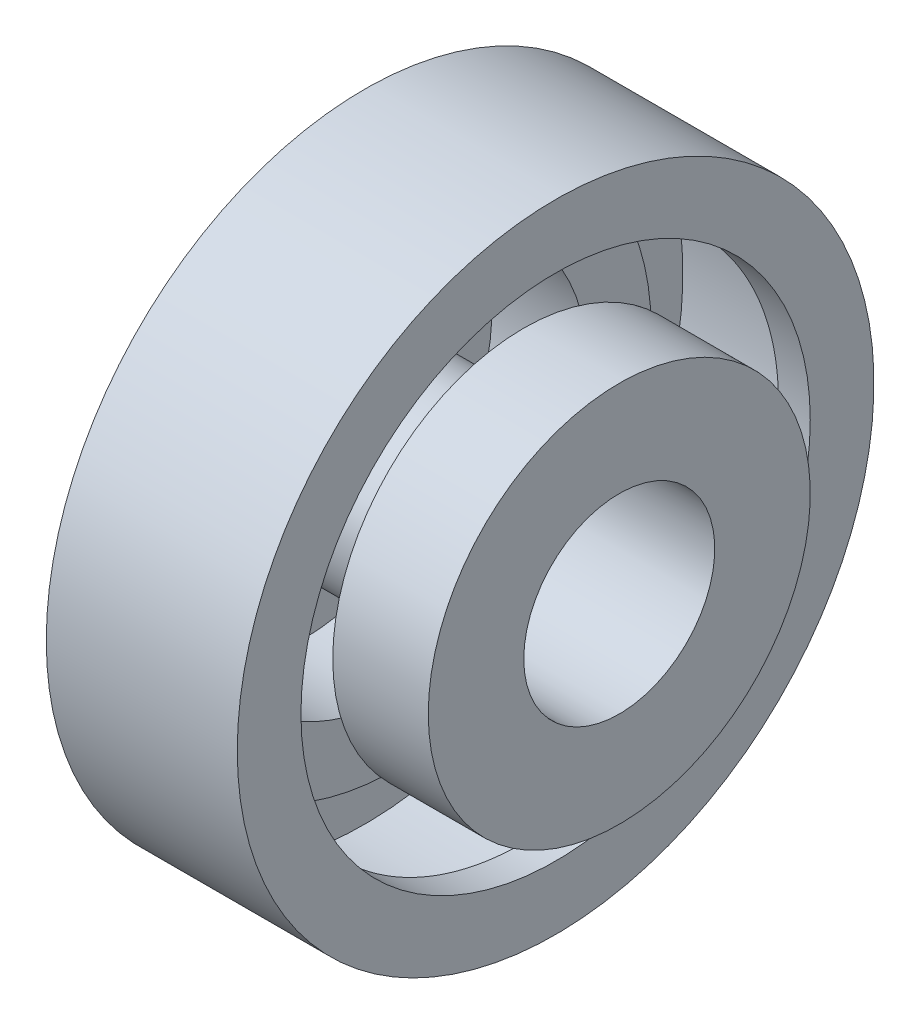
ISO-10303-21;
HEADER;
FILE_DESCRIPTION(('STEP AP214'),'2;1');
FILE_NAME('part.step','',(''),(''),'','','');
FILE_SCHEMA(('AUTOMOTIVE_DESIGN { 1 0 10303 214 1 1 1 1 }'));
ENDSEC;
DATA;
#1=APPLICATION_CONTEXT('core data for automotive mechanical design processes');
#2=APPLICATION_PROTOCOL_DEFINITION('international standard','automotive_design',2000,#1);
#3=PRODUCT_CONTEXT('',#1,'mechanical');
#4=PRODUCT('Part','Part','',(#3));
#5=PRODUCT_RELATED_PRODUCT_CATEGORY('part','',(#4));
#6=PRODUCT_DEFINITION_FORMATION('','',#4);
#7=PRODUCT_DEFINITION_CONTEXT('part definition',#1,'design');
#8=PRODUCT_DEFINITION('design','',#6,#7);
#9=PRODUCT_DEFINITION_SHAPE('','',#8);
#10=(LENGTH_UNIT() NAMED_UNIT(*) SI_UNIT(.MILLI.,.METRE.));
#11=(NAMED_UNIT(*) PLANE_ANGLE_UNIT() SI_UNIT($,.RADIAN.));
#12=(NAMED_UNIT(*) SI_UNIT($,.STERADIAN.) SOLID_ANGLE_UNIT());
#13=UNCERTAINTY_MEASURE_WITH_UNIT(LENGTH_MEASURE(1.E-05),#10,'distance_accuracy_value','');
#14=(GEOMETRIC_REPRESENTATION_CONTEXT(3) GLOBAL_UNCERTAINTY_ASSIGNED_CONTEXT((#13)) GLOBAL_UNIT_ASSIGNED_CONTEXT((#10,
#11,#12)) REPRESENTATION_CONTEXT('',''));
#15=CARTESIAN_POINT('',(0.,0.,0.));
#16=DIRECTION('',(0.,0.,1.));
#17=DIRECTION('',(1.,0.,0.));
#18=AXIS2_PLACEMENT_3D('',#15,#16,#17);
#19=CARTESIAN_POINT('',(2.,6.,0.));
#20=DIRECTION('',(-1.,0.,0.));
#21=DIRECTION('',(0.,0.,1.));
#22=AXIS2_PLACEMENT_3D('',#19,#20,#21);
#23=PLANE('',#22);
#24=CARTESIAN_POINT('',(2.,0.,-7.));
#25=DIRECTION('',(1.,0.,0.));
#26=DIRECTION('',(0.,0.,-1.));
#27=AXIS2_PLACEMENT_3D('',#24,#25,#26);
#28=CIRCLE('',#27,1.);
#29=CARTESIAN_POINT('',(2.,0.,-8.));
#30=VERTEX_POINT('',#29);
#31=CARTESIAN_POINT('',(2.,0.,-6.));
#32=VERTEX_POINT('',#31);
#33=EDGE_CURVE('E45',#30,#32,#28,.T.);
#34=ORIENTED_EDGE('',*,*,#33,.F.);
#35=CARTESIAN_POINT('',(2.,0.,0.));
#36=DIRECTION('',(-1.,0.,0.));
#37=DIRECTION('',(0.,0.,1.));
#38=AXIS2_PLACEMENT_3D('',#35,#36,#37);
#39=CIRCLE('',#38,8.);
#40=EDGE_CURVE('E64',#30,#30,#39,.T.);
#41=ORIENTED_EDGE('',*,*,#40,.F.);
#42=EDGE_CURVE('E57',#32,#30,#28,.T.);
#43=ORIENTED_EDGE('',*,*,#42,.F.);
#44=CARTESIAN_POINT('',(2.,0.,0.));
#45=DIRECTION('',(-1.,0.,0.));
#46=DIRECTION('',(0.,0.,1.));
#47=AXIS2_PLACEMENT_3D('',#44,#45,#46);
#48=CIRCLE('',#47,6.);
#49=EDGE_CURVE('E39',#32,#32,#48,.T.);
#50=ORIENTED_EDGE('',*,*,#49,.T.);
#51=EDGE_LOOP('',(#34,#41,#43,#50));
#52=FACE_BOUND('',#51,.T.);
#53=ADVANCED_FACE('F31',(#52),#23,.F.);
#54=CARTESIAN_POINT('',(5.,3.,0.));
#55=DIRECTION('',(-1.,0.,0.));
#56=DIRECTION('',(0.,0.,1.));
#57=AXIS2_PLACEMENT_3D('',#54,#55,#56);
#58=PLANE('',#57);
#59=CARTESIAN_POINT('',(5.,0.,0.));
#60=DIRECTION('',(-1.,0.,0.));
#61=DIRECTION('',(0.,0.,1.));
#62=AXIS2_PLACEMENT_3D('',#59,#60,#61);
#63=CIRCLE('',#62,6.00000000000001);
#64=CARTESIAN_POINT('',(5.,0.,6.00000000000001));
#65=VERTEX_POINT('',#64);
#66=EDGE_CURVE('E11',#65,#65,#63,.T.);
#67=ORIENTED_EDGE('',*,*,#66,.F.);
#68=EDGE_LOOP('',(#67));
#69=FACE_BOUND('',#68,.T.);
#70=CARTESIAN_POINT('',(5.,0.,0.));
#71=DIRECTION('',(-1.,0.,0.));
#72=DIRECTION('',(0.,0.,1.));
#73=AXIS2_PLACEMENT_3D('',#70,#71,#72);
#74=CIRCLE('',#73,3.);
#75=CARTESIAN_POINT('',(5.,0.,3.));
#76=VERTEX_POINT('',#75);
#77=EDGE_CURVE('E95',#76,#76,#74,.T.);
#78=ORIENTED_EDGE('',*,*,#77,.T.);
#79=EDGE_LOOP('',(#78));
#80=FACE_BOUND('',#79,.T.);
#81=ADVANCED_FACE('F33',(#69,#80),#58,.F.);
#82=CARTESIAN_POINT('',(-5.7575463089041,0.,0.));
#83=DIRECTION('',(-1.,0.,0.));
#84=DIRECTION('',(0.,0.,1.));
#85=AXIS2_PLACEMENT_3D('',#82,#83,#84);
#86=CYLINDRICAL_SURFACE('',#85,6.);
#87=ORIENTED_EDGE('',*,*,#49,.F.);
#88=EDGE_LOOP('',(#87));
#89=FACE_BOUND('',#88,.T.);
#90=ORIENTED_EDGE('',*,*,#66,.T.);
#91=EDGE_LOOP('',(#90));
#92=FACE_BOUND('',#91,.T.);
#93=ADVANCED_FACE('F125',(#89,#92),#86,.T.);
#94=CARTESIAN_POINT('',(-5.7575463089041,0.,0.));
#95=DIRECTION('',(-1.,0.,0.));
#96=DIRECTION('',(0.,0.,1.));
#97=AXIS2_PLACEMENT_3D('',#94,#95,#96);
#98=CYLINDRICAL_SURFACE('',#97,8.);
#99=CARTESIAN_POINT('',(3.,0.,0.));
#100=DIRECTION('',(-1.,0.,0.));
#101=DIRECTION('',(0.,0.,1.));
#102=AXIS2_PLACEMENT_3D('',#99,#100,#101);
#103=CIRCLE('',#102,8.);
#104=CARTESIAN_POINT('',(3.,0.,8.));
#105=VERTEX_POINT('',#104);
#106=EDGE_CURVE('E69',#105,#105,#103,.T.);
#107=ORIENTED_EDGE('',*,*,#106,.F.);
#108=EDGE_LOOP('',(#107));
#109=FACE_BOUND('',#108,.T.);
#110=ORIENTED_EDGE('',*,*,#40,.T.);
#111=EDGE_LOOP('',(#110));
#112=FACE_BOUND('',#111,.T.);
#113=ADVANCED_FACE('F68',(#109,#112),#98,.F.);
#114=CARTESIAN_POINT('',(3.,8.,0.));
#115=DIRECTION('',(-1.,0.,0.));
#116=DIRECTION('',(0.,0.,1.));
#117=AXIS2_PLACEMENT_3D('',#114,#115,#116);
#118=PLANE('',#117);
#119=CARTESIAN_POINT('',(3.,0.,0.));
#120=DIRECTION('',(-1.,0.,0.));
#121=DIRECTION('',(0.,0.,1.));
#122=AXIS2_PLACEMENT_3D('',#119,#120,#121);
#123=CIRCLE('',#122,10.);
#124=CARTESIAN_POINT('',(3.,0.,10.));
#125=VERTEX_POINT('',#124);
#126=EDGE_CURVE('E72',#125,#125,#123,.T.);
#127=ORIENTED_EDGE('',*,*,#126,.F.);
#128=EDGE_LOOP('',(#127));
#129=FACE_BOUND('',#128,.T.);
#130=ORIENTED_EDGE('',*,*,#106,.T.);
#131=EDGE_LOOP('',(#130));
#132=FACE_BOUND('',#131,.T.);
#133=ADVANCED_FACE('F134',(#129,#132),#118,.F.);
#134=CARTESIAN_POINT('',(-5.7575463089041,0.,0.));
#135=DIRECTION('',(-1.,0.,0.));
#136=DIRECTION('',(0.,0.,1.));
#137=AXIS2_PLACEMENT_3D('',#134,#135,#136);
#138=CYLINDRICAL_SURFACE('',#137,10.);
#139=CARTESIAN_POINT('',(-3.,0.,0.));
#140=DIRECTION('',(-1.,0.,0.));
#141=DIRECTION('',(0.,0.,1.));
#142=AXIS2_PLACEMENT_3D('',#139,#140,#141);
#143=CIRCLE('',#142,10.);
#144=CARTESIAN_POINT('',(-3.,0.,10.));
#145=VERTEX_POINT('',#144);
#146=EDGE_CURVE('E77',#145,#145,#143,.T.);
#147=ORIENTED_EDGE('',*,*,#146,.F.);
#148=EDGE_LOOP('',(#147));
#149=FACE_BOUND('',#148,.T.);
#150=ORIENTED_EDGE('',*,*,#126,.T.);
#151=EDGE_LOOP('',(#150));
#152=FACE_BOUND('',#151,.T.);
#153=ADVANCED_FACE('F144',(#149,#152),#138,.T.);
#154=CARTESIAN_POINT('',(-3.,8.,0.));
#155=DIRECTION('',(1.,0.,0.));
#156=DIRECTION('',(0.,0.,-1.));
#157=AXIS2_PLACEMENT_3D('',#154,#155,#156);
#158=PLANE('',#157);
#159=CARTESIAN_POINT('',(-3.,0.,0.));
#160=DIRECTION('',(-1.,0.,0.));
#161=DIRECTION('',(0.,0.,1.));
#162=AXIS2_PLACEMENT_3D('',#159,#160,#161);
#163=CIRCLE('',#162,8.);
#164=CARTESIAN_POINT('',(-3.,0.,8.));
#165=VERTEX_POINT('',#164);
#166=EDGE_CURVE('E80',#165,#165,#163,.T.);
#167=ORIENTED_EDGE('',*,*,#166,.F.);
#168=EDGE_LOOP('',(#167));
#169=FACE_BOUND('',#168,.T.);
#170=ORIENTED_EDGE('',*,*,#146,.T.);
#171=EDGE_LOOP('',(#170));
#172=FACE_BOUND('',#171,.T.);
#173=ADVANCED_FACE('F151',(#169,#172),#158,.F.);
#174=CARTESIAN_POINT('',(-5.7575463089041,0.,0.));
#175=DIRECTION('',(-1.,0.,0.));
#176=DIRECTION('',(0.,0.,1.));
#177=AXIS2_PLACEMENT_3D('',#174,#175,#176);
#178=CYLINDRICAL_SURFACE('',#177,8.);
#179=CARTESIAN_POINT('',(-2.,0.,0.));
#180=DIRECTION('',(-1.,0.,0.));
#181=DIRECTION('',(0.,0.,1.));
#182=AXIS2_PLACEMENT_3D('',#179,#180,#181);
#183=CIRCLE('',#182,8.);
#184=CARTESIAN_POINT('',(-2.,0.,-8.));
#185=VERTEX_POINT('',#184);
#186=EDGE_CURVE('E83',#185,#185,#183,.T.);
#187=ORIENTED_EDGE('',*,*,#186,.F.);
#188=EDGE_LOOP('',(#187));
#189=FACE_BOUND('',#188,.T.);
#190=ORIENTED_EDGE('',*,*,#166,.T.);
#191=EDGE_LOOP('',(#190));
#192=FACE_BOUND('',#191,.T.);
#193=ADVANCED_FACE('F158',(#189,#192),#178,.F.);
#194=CARTESIAN_POINT('',(-2.,6.,0.));
#195=DIRECTION('',(1.,0.,0.));
#196=DIRECTION('',(0.,0.,-1.));
#197=AXIS2_PLACEMENT_3D('',#194,#195,#196);
#198=PLANE('',#197);
#199=ORIENTED_EDGE('',*,*,#186,.T.);
#200=CARTESIAN_POINT('',(-2.,0.,-7.));
#201=DIRECTION('',(1.,0.,0.));
#202=DIRECTION('',(0.,0.,-1.));
#203=AXIS2_PLACEMENT_3D('',#200,#201,#202);
#204=CIRCLE('',#203,1.);
#205=CARTESIAN_POINT('',(-2.,0.,-6.));
#206=VERTEX_POINT('',#205);
#207=EDGE_CURVE('E52',#185,#206,#204,.T.);
#208=ORIENTED_EDGE('',*,*,#207,.T.);
#209=CARTESIAN_POINT('',(-2.,0.,0.));
#210=DIRECTION('',(-1.,0.,0.));
#211=DIRECTION('',(0.,0.,1.));
#212=AXIS2_PLACEMENT_3D('',#209,#210,#211);
#213=CIRCLE('',#212,6.);
#214=EDGE_CURVE('E86',#206,#206,#213,.T.);
#215=ORIENTED_EDGE('',*,*,#214,.F.);
#216=EDGE_CURVE('E66',#206,#185,#204,.T.);
#217=ORIENTED_EDGE('',*,*,#216,.T.);
#218=EDGE_LOOP('',(#199,#208,#215,#217));
#219=FACE_BOUND('',#218,.T.);
#220=ADVANCED_FACE('F100',(#219),#198,.F.);
#221=CARTESIAN_POINT('',(-5.7575463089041,0.,0.));
#222=DIRECTION('',(-1.,0.,0.));
#223=DIRECTION('',(0.,0.,1.));
#224=AXIS2_PLACEMENT_3D('',#221,#222,#223);
#225=CYLINDRICAL_SURFACE('',#224,6.);
#226=ORIENTED_EDGE('',*,*,#214,.T.);
#227=EDGE_LOOP('',(#226));
#228=FACE_BOUND('',#227,.T.);
#229=CARTESIAN_POINT('',(-5.,0.,0.));
#230=DIRECTION('',(-1.,0.,0.));
#231=DIRECTION('',(0.,0.,1.));
#232=AXIS2_PLACEMENT_3D('',#229,#230,#231);
#233=CIRCLE('',#232,6.00000000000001);
#234=CARTESIAN_POINT('',(-5.,0.,6.00000000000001));
#235=VERTEX_POINT('',#234);
#236=EDGE_CURVE('E89',#235,#235,#233,.T.);
#237=ORIENTED_EDGE('',*,*,#236,.F.);
#238=EDGE_LOOP('',(#237));
#239=FACE_BOUND('',#238,.T.);
#240=ADVANCED_FACE('F103',(#228,#239),#225,.T.);
#241=CARTESIAN_POINT('',(-5.,3.,0.));
#242=DIRECTION('',(1.,0.,0.));
#243=DIRECTION('',(0.,0.,-1.));
#244=AXIS2_PLACEMENT_3D('',#241,#242,#243);
#245=PLANE('',#244);
#246=CARTESIAN_POINT('',(-5.,0.,0.));
#247=DIRECTION('',(-1.,0.,0.));
#248=DIRECTION('',(0.,0.,1.));
#249=AXIS2_PLACEMENT_3D('',#246,#247,#248);
#250=CIRCLE('',#249,3.);
#251=CARTESIAN_POINT('',(-5.,0.,3.));
#252=VERTEX_POINT('',#251);
#253=EDGE_CURVE('E92',#252,#252,#250,.T.);
#254=ORIENTED_EDGE('',*,*,#253,.F.);
#255=EDGE_LOOP('',(#254));
#256=FACE_BOUND('',#255,.T.);
#257=ORIENTED_EDGE('',*,*,#236,.T.);
#258=EDGE_LOOP('',(#257));
#259=FACE_BOUND('',#258,.T.);
#260=ADVANCED_FACE('F106',(#256,#259),#245,.F.);
#261=CARTESIAN_POINT('',(-5.7575463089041,0.,0.));
#262=DIRECTION('',(-1.,0.,0.));
#263=DIRECTION('',(0.,0.,1.));
#264=AXIS2_PLACEMENT_3D('',#261,#262,#263);
#265=CYLINDRICAL_SURFACE('',#264,3.);
#266=ORIENTED_EDGE('',*,*,#77,.F.);
#267=EDGE_LOOP('',(#266));
#268=FACE_BOUND('',#267,.T.);
#269=ORIENTED_EDGE('',*,*,#253,.T.);
#270=EDGE_LOOP('',(#269));
#271=FACE_BOUND('',#270,.T.);
#272=ADVANCED_FACE('F111',(#268,#271),#265,.F.);
#273=CARTESIAN_POINT('',(-5.,0.,-7.));
#274=DIRECTION('',(1.,0.,0.));
#275=DIRECTION('',(0.,0.,-1.));
#276=AXIS2_PLACEMENT_3D('',#273,#274,#275);
#277=CYLINDRICAL_SURFACE('',#276,1.);
#278=ORIENTED_EDGE('',*,*,#33,.T.);
#279=ORIENTED_EDGE('',*,*,#42,.T.);
#280=EDGE_LOOP('',(#278,#279));
#281=FACE_BOUND('',#280,.T.);
#282=ORIENTED_EDGE('',*,*,#216,.F.);
#283=ORIENTED_EDGE('',*,*,#207,.F.);
#284=EDGE_LOOP('',(#282,#283));
#285=FACE_BOUND('',#284,.T.);
#286=ADVANCED_FACE('F58',(#281,#285),#277,.F.);
#287=CLOSED_SHELL('',(#53,#81,#93,#113,#133,#153,#173,#193,#220,#240,#260,#272,#286));
#288=MANIFOLD_SOLID_BREP('B2',#287);
#289=ADVANCED_BREP_SHAPE_REPRESENTATION('',(#18,#288),#14);
#290=SHAPE_DEFINITION_REPRESENTATION(#9,#289);
ENDSEC;
END-ISO-10303-21;
